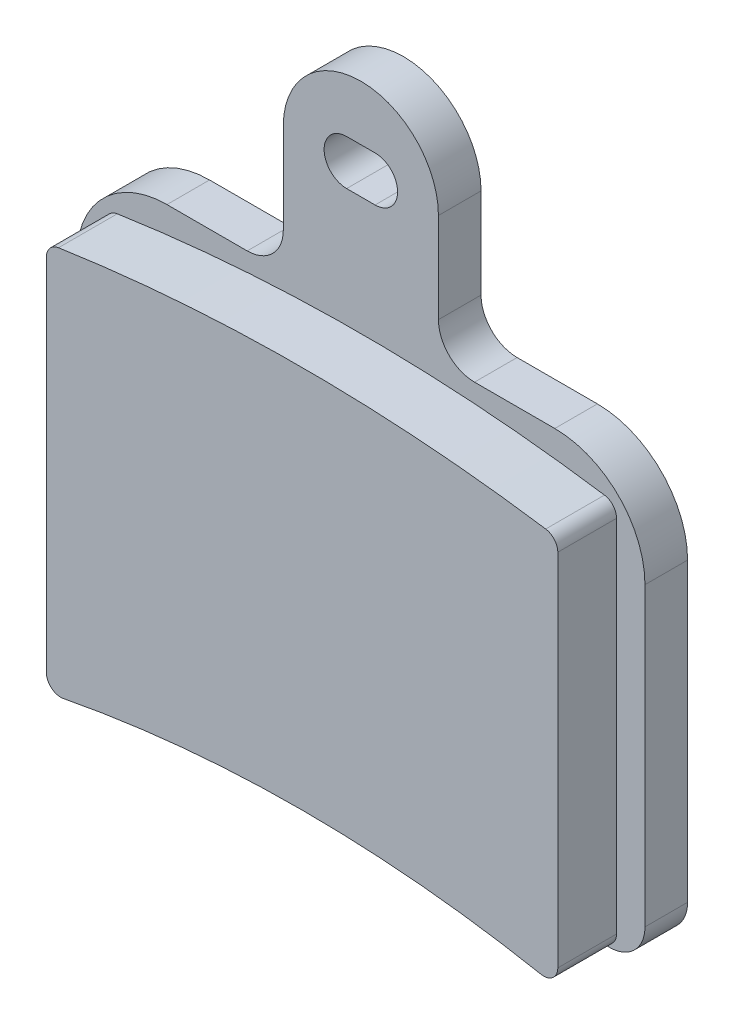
from build123d import *

# Parameters (mm, degrees)
BOSS_EXTRUDE1_DEPTH = 3
CUT_EXTRUDE1_DEPTH  = 47.990917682
BOSS_EXTRUDE2_DEPTH = 4.13578


with BuildPart() as part:
    # Sketch1 → Boss-Extrude1 (new body)
    with BuildSketch(Plane.XY):
        with BuildLine():
            Line((-5.461, -3.81), (-5.461, -10.16))
            ThreePointArc((-5.461, -10.16), (-6.204948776, -11.956051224), (-8.001, -12.7))
            Line((-8.001, -12.7), (-13.6525, -12.7))
            ThreePointArc((-13.6525, -12.7), (-18.142628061, -14.559871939), (-20.0025, -19.05))
            Line((-20.0025, -19.05), (-20.0025, -39.915166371))
            ThreePointArc((-20.0025, -39.915166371), (-19.09202084, -41.84478382), (-17.023761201, -42.36890009))
            ThreePointArc((-17.023761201, -42.36890009), (1.717e-06, -40.723671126), (17.023771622, -42.368827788))
            ThreePointArc((17.023771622, -42.368827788), (19.092024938, -41.84470611), (20.0025, -39.915092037))
            Line((20.0025, -39.915092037), (20.0025, -19.05))
            ThreePointArc((20.0025, -19.05), (18.142628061, -14.559871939), (13.6525, -12.7))
            Line((13.6525, -12.7), (8.001, -12.7))
            ThreePointArc((8.001, -12.7), (6.204948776, -11.956051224), (5.461, -10.16))
            Line((5.461, -10.16), (5.461, -3.81))
            ThreePointArc((5.461, -3.81), (0, 1.651), (-5.461, -3.81))
        make_face()
    extrude(amount=BOSS_EXTRUDE1_DEPTH)

    # Sketch3 → Cut-Extrude1 (cut, through all)
    with BuildSketch(Plane.XY.offset(3)):
        with BuildLine():
            Line((-1, -2.2225), (1, -2.2225))
            ThreePointArc((1, -2.2225), (2.5875, -3.81), (1, -5.3975))
            Line((1, -5.3975), (-1, -5.3975))
            ThreePointArc((-1, -5.3975), (-2.5875, -3.81), (-1, -2.2225))
        make_face()
    extrude(amount=-CUT_EXTRUDE1_DEPTH, mode=Mode.SUBTRACT)


with BuildPart() as body_2:
    # Sketch2 → Boss-Extrude2 (new body)
    with BuildSketch(Plane.XY.offset(3)):
        with BuildLine():
            Line((-18.0025, -41.346162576), (-18.0025, -16.00128701))
            ThreePointArc((-18.0025, -16.00128701), (-17.760125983, -15.348598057), (-17.15049426, -15.012298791))
            ThreePointArc((-17.15049426, -15.012298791), (-3.798e-06, -13.736171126), (17.150490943, -15.012241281))
            ThreePointArc((17.150490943, -15.012241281), (17.760124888, -15.348539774), (18.0025, -16.001229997))
            Line((18.0025, -16.001229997), (18.0025, -41.346089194))
            ThreePointArc((18.0025, -41.346089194), (17.639239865, -42.117167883), (16.813375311, -42.328042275))
            ThreePointArc((16.813375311, -42.328042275), (-1.343e-06, -40.723671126), (-16.813371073, -42.32811484))
            ThreePointArc((-16.813371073, -42.32811484), (-17.639238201, -42.117242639), (-18.0025, -41.346162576))
        make_face()
    extrude(amount=BOSS_EXTRUDE2_DEPTH)


solid = Compound([part.part, body_2.part])
